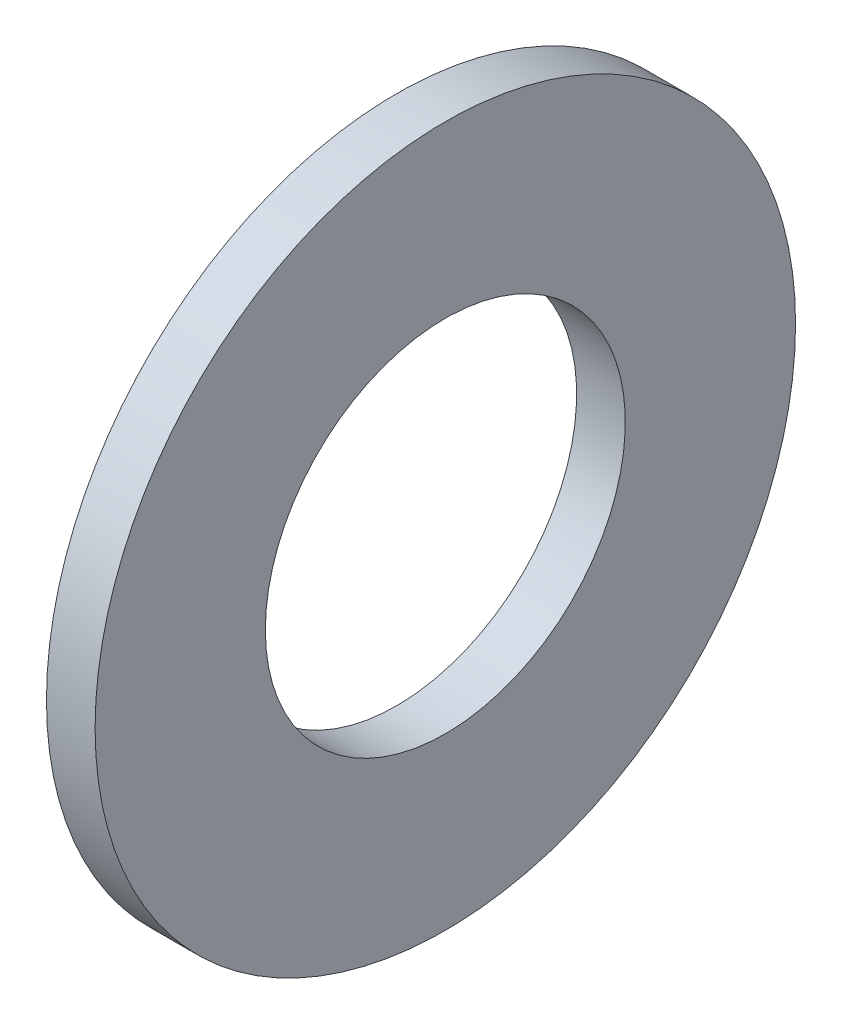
ISO-10303-21;
HEADER;
FILE_DESCRIPTION(('STEP AP214'),'2;1');
FILE_NAME('part.step','',(''),(''),'','','');
FILE_SCHEMA(('AUTOMOTIVE_DESIGN { 1 0 10303 214 1 1 1 1 }'));
ENDSEC;
DATA;
#1=APPLICATION_CONTEXT('core data for automotive mechanical design processes');
#2=APPLICATION_PROTOCOL_DEFINITION('international standard','automotive_design',2000,#1);
#3=PRODUCT_CONTEXT('',#1,'mechanical');
#4=PRODUCT('Part','Part','',(#3));
#5=PRODUCT_RELATED_PRODUCT_CATEGORY('part','',(#4));
#6=PRODUCT_DEFINITION_FORMATION('','',#4);
#7=PRODUCT_DEFINITION_CONTEXT('part definition',#1,'design');
#8=PRODUCT_DEFINITION('design','',#6,#7);
#9=PRODUCT_DEFINITION_SHAPE('','',#8);
#10=(LENGTH_UNIT() NAMED_UNIT(*) SI_UNIT(.MILLI.,.METRE.));
#11=(NAMED_UNIT(*) PLANE_ANGLE_UNIT() SI_UNIT($,.RADIAN.));
#12=(NAMED_UNIT(*) SI_UNIT($,.STERADIAN.) SOLID_ANGLE_UNIT());
#13=UNCERTAINTY_MEASURE_WITH_UNIT(LENGTH_MEASURE(1.E-05),#10,'distance_accuracy_value','');
#14=(GEOMETRIC_REPRESENTATION_CONTEXT(3) GLOBAL_UNCERTAINTY_ASSIGNED_CONTEXT((#13)) GLOBAL_UNIT_ASSIGNED_CONTEXT((#10,
#11,#12)) REPRESENTATION_CONTEXT('',''));
#15=CARTESIAN_POINT('',(0.,0.,0.));
#16=DIRECTION('',(0.,0.,1.));
#17=DIRECTION('',(1.,0.,0.));
#18=AXIS2_PLACEMENT_3D('',#15,#16,#17);
#19=CARTESIAN_POINT('',(-34.9249999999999,0.,0.));
#20=DIRECTION('',(-1.,0.,0.));
#21=DIRECTION('',(0.,0.,1.));
#22=AXIS2_PLACEMENT_3D('',#19,#20,#21);
#23=CYLINDRICAL_SURFACE('',#22,18.5);
#24=CARTESIAN_POINT('',(0.,0.,0.));
#25=DIRECTION('',(-1.,0.,0.));
#26=DIRECTION('',(0.,0.,1.));
#27=AXIS2_PLACEMENT_3D('',#24,#25,#26);
#28=CIRCLE('',#27,18.5);
#29=CARTESIAN_POINT('',(0.,0.,18.5));
#30=VERTEX_POINT('',#29);
#31=EDGE_CURVE('E10',#30,#30,#28,.T.);
#32=ORIENTED_EDGE('',*,*,#31,.F.);
#33=EDGE_LOOP('',(#32));
#34=FACE_BOUND('',#33,.T.);
#35=CARTESIAN_POINT('',(-5.,0.,0.));
#36=DIRECTION('',(-1.,0.,0.));
#37=DIRECTION('',(0.,0.,1.));
#38=AXIS2_PLACEMENT_3D('',#35,#36,#37);
#39=CIRCLE('',#38,18.5);
#40=CARTESIAN_POINT('',(-5.,0.,18.5));
#41=VERTEX_POINT('',#40);
#42=EDGE_CURVE('E44',#41,#41,#39,.T.);
#43=ORIENTED_EDGE('',*,*,#42,.T.);
#44=EDGE_LOOP('',(#43));
#45=FACE_BOUND('',#44,.T.);
#46=ADVANCED_FACE('F30',(#34,#45),#23,.F.);
#47=CARTESIAN_POINT('',(0.,18.5,0.));
#48=DIRECTION('',(-1.,0.,0.));
#49=DIRECTION('',(0.,0.,1.));
#50=AXIS2_PLACEMENT_3D('',#47,#48,#49);
#51=PLANE('',#50);
#52=CARTESIAN_POINT('',(0.,0.,0.));
#53=DIRECTION('',(-1.,0.,0.));
#54=DIRECTION('',(0.,0.,1.));
#55=AXIS2_PLACEMENT_3D('',#52,#53,#54);
#56=CIRCLE('',#55,36.);
#57=CARTESIAN_POINT('',(0.,0.,36.));
#58=VERTEX_POINT('',#57);
#59=EDGE_CURVE('E36',#58,#58,#56,.T.);
#60=ORIENTED_EDGE('',*,*,#59,.F.);
#61=EDGE_LOOP('',(#60));
#62=FACE_BOUND('',#61,.T.);
#63=ORIENTED_EDGE('',*,*,#31,.T.);
#64=EDGE_LOOP('',(#63));
#65=FACE_BOUND('',#64,.T.);
#66=ADVANCED_FACE('F59',(#62,#65),#51,.F.);
#67=CARTESIAN_POINT('',(-34.9249999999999,0.,0.));
#68=DIRECTION('',(-1.,0.,0.));
#69=DIRECTION('',(0.,0.,1.));
#70=AXIS2_PLACEMENT_3D('',#67,#68,#69);
#71=CYLINDRICAL_SURFACE('',#70,36.);
#72=CARTESIAN_POINT('',(-5.,0.,0.));
#73=DIRECTION('',(-1.,0.,0.));
#74=DIRECTION('',(0.,0.,1.));
#75=AXIS2_PLACEMENT_3D('',#72,#73,#74);
#76=CIRCLE('',#75,36.);
#77=CARTESIAN_POINT('',(-5.,0.,36.));
#78=VERTEX_POINT('',#77);
#79=EDGE_CURVE('E40',#78,#78,#76,.T.);
#80=ORIENTED_EDGE('',*,*,#79,.F.);
#81=EDGE_LOOP('',(#80));
#82=FACE_BOUND('',#81,.T.);
#83=ORIENTED_EDGE('',*,*,#59,.T.);
#84=EDGE_LOOP('',(#83));
#85=FACE_BOUND('',#84,.T.);
#86=ADVANCED_FACE('F54',(#82,#85),#71,.T.);
#87=CARTESIAN_POINT('',(-5.,36.,0.));
#88=DIRECTION('',(1.,0.,0.));
#89=DIRECTION('',(0.,0.,-1.));
#90=AXIS2_PLACEMENT_3D('',#87,#88,#89);
#91=PLANE('',#90);
#92=ORIENTED_EDGE('',*,*,#42,.F.);
#93=EDGE_LOOP('',(#92));
#94=FACE_BOUND('',#93,.T.);
#95=ORIENTED_EDGE('',*,*,#79,.T.);
#96=EDGE_LOOP('',(#95));
#97=FACE_BOUND('',#96,.T.);
#98=ADVANCED_FACE('F51',(#94,#97),#91,.F.);
#99=CLOSED_SHELL('',(#46,#66,#86,#98));
#100=MANIFOLD_SOLID_BREP('B2',#99);
#101=ADVANCED_BREP_SHAPE_REPRESENTATION('',(#18,#100),#14);
#102=SHAPE_DEFINITION_REPRESENTATION(#9,#101);
ENDSEC;
END-ISO-10303-21;
